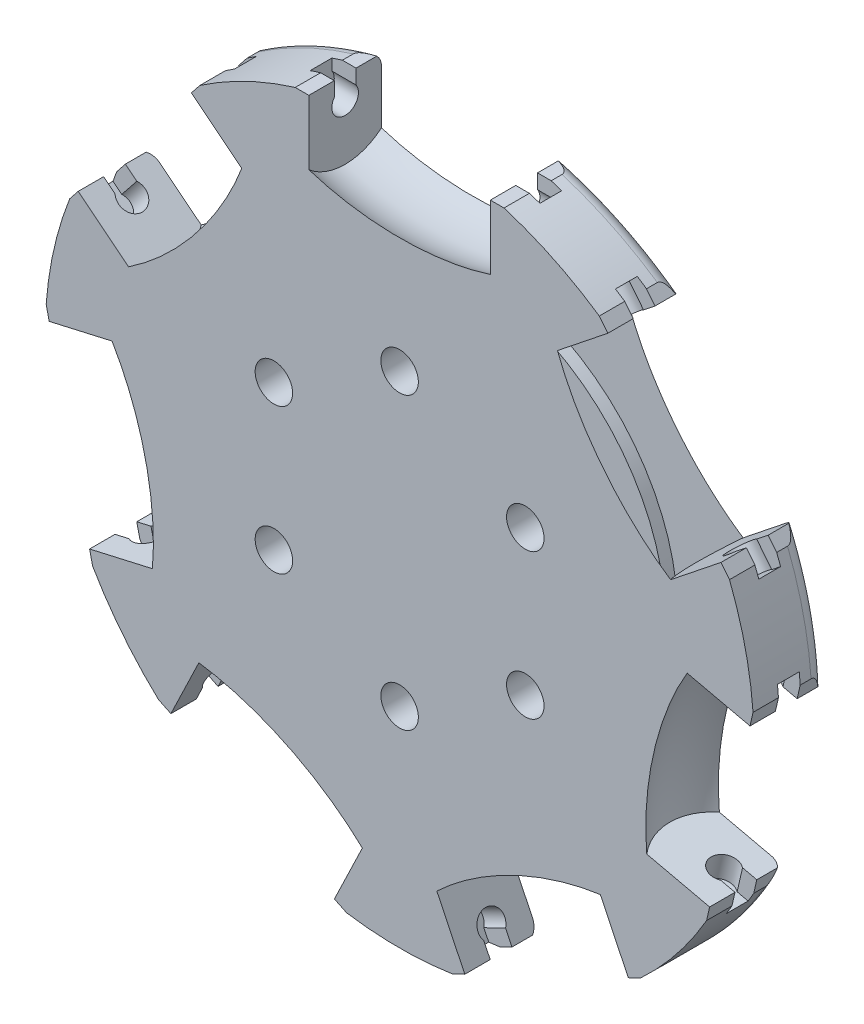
from build123d import *

# Parameters (mm, degrees)
BOSS_EXTRUDE1_DEPTH      = 3
BOSS_EXTRUDE1_DEPTH_BACK = 3
SKETCH8_R                = 6
BOSS_EXTRUDE2_DEPTH      = 0.5
CIRPATTERN2_COUNT        = 7
CUT_EXTRUDE1_START       = -2
CUT_EXTRUDE1_DEPTH       = 19
CIRPATTERN3_COUNT        = 7
CUT_EXTRUDE2_DEPTH       = 1.5
SKETCH11_R               = 17
CUT_EXTRUDE3_DEPTH       = 1
SKETCH12_R               = 1.55
CUT_EXTRUDE4_DEPTH       = 44.750064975
SKETCH13_R               = 39.3
SKETCH13_R_2             = 29.3
CUT_EXTRUDE_THIN1_DEPTH  = 10
SKETCH15_R               = 6
CUT_EXTRUDE6_DEPTH       = 3.5
FILLET1_R                = 1.2


with BuildPart() as part:
    # Sketch2 → Boss-Extrude1 (new, two sides: drawn at the far end of the back side and taken through both)
    with BuildSketch(Plane.XY.offset(-BOSS_EXTRUDE1_DEPTH_BACK)):
        Polygon((-13.484089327, 28), (-30.298473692, 6.915428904), (-24.297489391, -19.376601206), (0, -31.077655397), (24.297489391, -19.376601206), (30.298473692, 6.915428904), (13.484089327, 28), align=None)
    extrude(amount=BOSS_EXTRUDE1_DEPTH + BOSS_EXTRUDE1_DEPTH_BACK)

    # Sketch3 → Cut-Revolve1 (revolve, cut)
    with BuildSketch(Plane.XY):
        with BuildLine():
            Line((-7.501085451, 30.758819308), (-7.501085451, 26.158819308))
            Line((-7.501085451, 26.158819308), (7.501085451, 26.158819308))
            Line((7.501085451, 26.158819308), (7.501085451, 30.758819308))
            ThreePointArc((7.501085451, 30.758819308), (0, 31.660247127), (-7.501085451, 30.758819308))
        make_face()
    cut_revolve1 = revolve(axis=Axis((-7.501085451, 26.158819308, 0), (1, 0, 0)), mode=Mode.SUBTRACT)

    # Sketch8 → Boss-Extrude2 (add)
    with BuildSketch(Plane.XY.offset(3)):
        Circle(SKETCH8_R)
    extrude(amount=BOSS_EXTRUDE2_DEPTH)

    # CirPattern2: Cut-Revolve1 ×7 about axis
    cirpattern2_axis = Axis((0, 0, 0), (0, 0, 1))
    for i in range(1, CIRPATTERN2_COUNT):
        add(cut_revolve1.rotate(cirpattern2_axis, i * 360 / CIRPATTERN2_COUNT), mode=Mode.SUBTRACT)

    # Sketch9 → Cut-Extrude1 (cut)
    with BuildSketch(Plane(origin=(-7.501085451, 0, 0), x_dir=(0, 0, -1), z_dir=(1, 0, 0)).offset(CUT_EXTRUDE1_START)):
        with BuildLine():
            Line((0.9, 26.79127484), (0.9, 28))
            Line((0.9, 28), (-0.9, 28))
            Line((-0.9, 28), (-0.9, 26.79127484))
            ThreePointArc((-0.9, 26.79127484), (0, 25.058819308), (0.9, 26.79127484))
        make_face()
    cut_extrude1 = extrude(amount=CUT_EXTRUDE1_DEPTH, mode=Mode.SUBTRACT)

    # CirPattern3: Cut-Extrude1 ×7 about axis
    cirpattern3_axis = Axis((0, 0, 0), (0, 0, 1))
    for i in range(1, CIRPATTERN3_COUNT):
        add(cut_extrude1.rotate(cirpattern3_axis, i * 360 / CIRPATTERN3_COUNT), mode=Mode.SUBTRACT)

    # Sketch10 → Cut-Extrude2 (cut)
    with BuildSketch(Plane(origin=(0, 0, -3), x_dir=(-1, 0, 0), z_dir=(0, 0, -1))):
        with BuildLine():
            Line((8.806636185, 0.997780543), (-8.806636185, 0.997780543))
            add(Edge.make_bspline(
                [(0, 8.148209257), (-3.931052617, 8.253043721), (-9.168389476, 5.62848731), (-8.806636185, 0.997780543)],
                knots=[0, 0, 0, 0, 1, 1, 1, 1], degree=3))
            add(Edge.make_bspline(
                [(0, 8.148209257), (3.931052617, 8.253043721), (9.168389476, 5.62848731), (8.806636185, 0.997780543)],
                knots=[0, 0, 0, 0, 1, 1, 1, 1], degree=3))
        make_face()
        with BuildLine():
            Line((2.114876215, 0.243663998), (-2.114876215, 0.243663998))
            ThreePointArc((-2.114876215, 0.243663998), (-3.640317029, -2.401018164), (-5.146046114, 0.254936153))
            Line((-5.146046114, 0.254936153), (-8.806636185, 0.254936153))
            add(Edge.make_bspline(
                [(-8.806636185, 0.254936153), (-8.762602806, -2.64242158), (-5.109809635, -5.58689115), (-1.247859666, -5.953148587), (0, -5.875970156)],
                knots=[0, 0, 0, 0, 0.688471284, 1, 1, 1, 1], degree=3))
            add(Edge.make_bspline(
                [(8.806636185, 0.254936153), (8.762602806, -2.64242158), (5.109809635, -5.58689115), (1.247859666, -5.953148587), (0, -5.875970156)],
                knots=[0, 0, 0, 0, 0.688471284, 1, 1, 1, 1], degree=3))
            Line((8.806636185, 0.254936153), (5.146046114, 0.254936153))
            ThreePointArc((5.146046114, 0.254936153), (3.640317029, -2.401018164), (2.114876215, 0.243663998))
        make_face()
        with BuildLine():
            ThreePointArc((9.688662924, 2.232117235), (9.723739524, -0.199474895), (9.141368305, -2.56055821))
            ThreePointArc((9.141368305, -2.56055821), (10.947749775, -0.339249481), (9.688662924, 2.232117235))
        make_face()
        with BuildLine():
            ThreePointArc((-9.688662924, 2.232117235), (-9.723739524, -0.199474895), (-9.141368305, -2.56055821))
            ThreePointArc((-9.141368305, -2.56055821), (-10.947749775, -0.339249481), (-9.688662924, 2.232117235))
        make_face()
    extrude(amount=-CUT_EXTRUDE2_DEPTH, mode=Mode.SUBTRACT)

    # Sketch11 → Cut-Extrude3 (cut)
    with BuildSketch(Plane(origin=(0, 0, -3), x_dir=(-1, 0, 0), z_dir=(0, 0, -1))):
        Circle(SKETCH11_R)
    extrude(amount=-CUT_EXTRUDE3_DEPTH, mode=Mode.SUBTRACT)

    # Sketch12 → Cut-Extrude4 (cut, through all)
    with BuildSketch(Plane(origin=(0, 0, -2), x_dir=(-1, 0, 0), z_dir=(0, 0, -1))):
        with Locations((0, 12)):
            Circle(SKETCH12_R)
        with Locations((10.392304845, 6)):
            Circle(SKETCH12_R)
        with Locations((10.392304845, -6)):
            Circle(SKETCH12_R)
        with Locations((0, -12)):
            Circle(SKETCH12_R)
        with Locations((-10.392304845, -6)):
            Circle(SKETCH12_R)
        with Locations((-10.392304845, 6)):
            Circle(SKETCH12_R)
    extrude(amount=-CUT_EXTRUDE4_DEPTH, mode=Mode.SUBTRACT)

    # Sketch13 → Cut-Extrude-Thin1 (cut)
    with BuildSketch(Plane(origin=(0, 0, -3), x_dir=(-1, 0, 0), z_dir=(0, 0, -1))):
        Circle(SKETCH13_R)
        Circle(SKETCH13_R_2, mode=Mode.SUBTRACT)
    extrude(amount=-CUT_EXTRUDE_THIN1_DEPTH, mode=Mode.SUBTRACT)

    # Sketch15 → Cut-Extrude6 (cut)
    with BuildSketch(Plane.XY.offset(3)):
        Circle(SKETCH15_R)
    extrude(amount=CUT_EXTRUDE6_DEPTH, mode=Mode.SUBTRACT)

    # Fillet1
    fillet1_edges = [part.edges().sort_by_distance(p)[0] for p in [
        (-12.712793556, 26.39838783, -3),
        (-28.565387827, 6.519863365, -3),
        (-22.907662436, -18.268251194, -3),
        (0, -29.3, -3),
        (22.907662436, -18.268251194, -3),
        (28.565387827, 6.519863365, -3),
        (12.712793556, 26.39838783, -3),
    ]]
    fillet(fillet1_edges, radius=FILLET1_R)


solid = part.part
